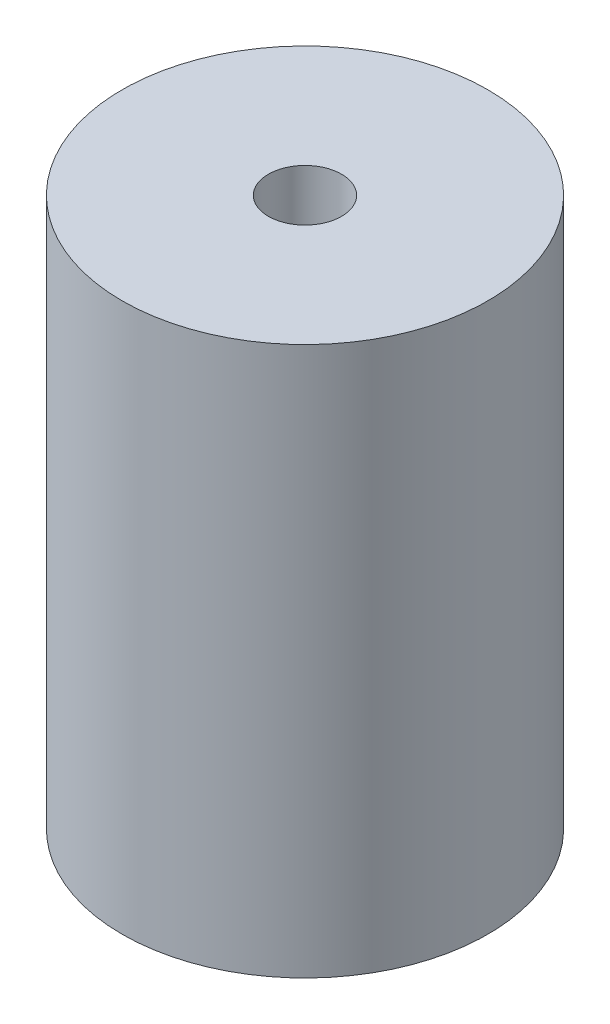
ISO-10303-21;
HEADER;
FILE_DESCRIPTION(('STEP AP214'),'2;1');
FILE_NAME('part.step','',(''),(''),'','','');
FILE_SCHEMA(('AUTOMOTIVE_DESIGN { 1 0 10303 214 1 1 1 1 }'));
ENDSEC;
DATA;
#1=APPLICATION_CONTEXT('core data for automotive mechanical design processes');
#2=APPLICATION_PROTOCOL_DEFINITION('international standard','automotive_design',2000,#1);
#3=PRODUCT_CONTEXT('',#1,'mechanical');
#4=PRODUCT('Part','Part','',(#3));
#5=PRODUCT_RELATED_PRODUCT_CATEGORY('part','',(#4));
#6=PRODUCT_DEFINITION_FORMATION('','',#4);
#7=PRODUCT_DEFINITION_CONTEXT('part definition',#1,'design');
#8=PRODUCT_DEFINITION('design','',#6,#7);
#9=PRODUCT_DEFINITION_SHAPE('','',#8);
#10=(LENGTH_UNIT() NAMED_UNIT(*) SI_UNIT(.MILLI.,.METRE.));
#11=(NAMED_UNIT(*) PLANE_ANGLE_UNIT() SI_UNIT($,.RADIAN.));
#12=(NAMED_UNIT(*) SI_UNIT($,.STERADIAN.) SOLID_ANGLE_UNIT());
#13=UNCERTAINTY_MEASURE_WITH_UNIT(LENGTH_MEASURE(1.E-05),#10,'distance_accuracy_value','');
#14=(GEOMETRIC_REPRESENTATION_CONTEXT(3) GLOBAL_UNCERTAINTY_ASSIGNED_CONTEXT((#13)) GLOBAL_UNIT_ASSIGNED_CONTEXT((#10,
#11,#12)) REPRESENTATION_CONTEXT('',''));
#15=CARTESIAN_POINT('',(0.,0.,0.));
#16=DIRECTION('',(0.,0.,1.));
#17=DIRECTION('',(1.,0.,0.));
#18=AXIS2_PLACEMENT_3D('',#15,#16,#17);
#19=CARTESIAN_POINT('',(0.,30.,0.));
#20=DIRECTION('',(0.,-1.,0.));
#21=DIRECTION('',(0.,0.,-1.));
#22=AXIS2_PLACEMENT_3D('',#19,#20,#21);
#23=CYLINDRICAL_SURFACE('',#22,10.);
#24=CARTESIAN_POINT('',(0.,30.,0.));
#25=DIRECTION('',(0.,1.,0.));
#26=DIRECTION('',(0.,0.,1.));
#27=AXIS2_PLACEMENT_3D('',#24,#25,#26);
#28=CIRCLE('',#27,10.);
#29=CARTESIAN_POINT('',(0.,30.,10.));
#30=VERTEX_POINT('',#29);
#31=EDGE_CURVE('E10',#30,#30,#28,.T.);
#32=ORIENTED_EDGE('',*,*,#31,.F.);
#33=EDGE_LOOP('',(#32));
#34=FACE_BOUND('',#33,.T.);
#35=CARTESIAN_POINT('',(0.,0.,0.));
#36=DIRECTION('',(0.,1.,0.));
#37=DIRECTION('',(0.,0.,1.));
#38=AXIS2_PLACEMENT_3D('',#35,#36,#37);
#39=CIRCLE('',#38,10.);
#40=CARTESIAN_POINT('',(0.,0.,10.));
#41=VERTEX_POINT('',#40);
#42=EDGE_CURVE('E36',#41,#41,#39,.T.);
#43=ORIENTED_EDGE('',*,*,#42,.T.);
#44=EDGE_LOOP('',(#43));
#45=FACE_BOUND('',#44,.T.);
#46=ADVANCED_FACE('F33',(#34,#45),#23,.T.);
#47=CARTESIAN_POINT('',(0.,30.,0.));
#48=DIRECTION('',(0.,1.,0.));
#49=DIRECTION('',(0.,0.,1.));
#50=AXIS2_PLACEMENT_3D('',#47,#48,#49);
#51=PLANE('',#50);
#52=CARTESIAN_POINT('',(0.,30.,0.));
#53=DIRECTION('',(0.,1.,0.));
#54=DIRECTION('',(0.,0.,1.));
#55=AXIS2_PLACEMENT_3D('',#52,#53,#54);
#56=CIRCLE('',#55,2.);
#57=CARTESIAN_POINT('',(0.,30.,2.));
#58=VERTEX_POINT('',#57);
#59=EDGE_CURVE('E45',#58,#58,#56,.T.);
#60=ORIENTED_EDGE('',*,*,#59,.F.);
#61=EDGE_LOOP('',(#60));
#62=FACE_BOUND('',#61,.T.);
#63=ORIENTED_EDGE('',*,*,#31,.T.);
#64=EDGE_LOOP('',(#63));
#65=FACE_BOUND('',#64,.T.);
#66=ADVANCED_FACE('F70',(#62,#65),#51,.T.);
#67=CARTESIAN_POINT('',(0.,0.,0.));
#68=DIRECTION('',(0.,1.,0.));
#69=DIRECTION('',(0.,0.,1.));
#70=AXIS2_PLACEMENT_3D('',#67,#68,#69);
#71=PLANE('',#70);
#72=CARTESIAN_POINT('',(0.,0.,0.));
#73=DIRECTION('',(0.,-1.,0.));
#74=DIRECTION('',(0.,0.,-1.));
#75=AXIS2_PLACEMENT_3D('',#72,#73,#74);
#76=CIRCLE('',#75,4.);
#77=CARTESIAN_POINT('',(0.,0.,-4.));
#78=VERTEX_POINT('',#77);
#79=EDGE_CURVE('E51',#78,#78,#76,.T.);
#80=ORIENTED_EDGE('',*,*,#79,.F.);
#81=EDGE_LOOP('',(#80));
#82=FACE_BOUND('',#81,.T.);
#83=ORIENTED_EDGE('',*,*,#42,.F.);
#84=EDGE_LOOP('',(#83));
#85=FACE_BOUND('',#84,.T.);
#86=ADVANCED_FACE('F66',(#82,#85),#71,.F.);
#87=CARTESIAN_POINT('',(0.,22.,0.));
#88=DIRECTION('',(0.,1.,0.));
#89=DIRECTION('',(0.,0.,1.));
#90=AXIS2_PLACEMENT_3D('',#87,#88,#89);
#91=CYLINDRICAL_SURFACE('',#90,2.);
#92=CARTESIAN_POINT('',(0.,22.,0.));
#93=DIRECTION('',(0.,1.,0.));
#94=DIRECTION('',(0.,0.,1.));
#95=AXIS2_PLACEMENT_3D('',#92,#93,#94);
#96=CIRCLE('',#95,2.);
#97=CARTESIAN_POINT('',(0.,22.,2.));
#98=VERTEX_POINT('',#97);
#99=EDGE_CURVE('E43',#98,#98,#96,.T.);
#100=ORIENTED_EDGE('',*,*,#99,.F.);
#101=EDGE_LOOP('',(#100));
#102=FACE_BOUND('',#101,.T.);
#103=ORIENTED_EDGE('',*,*,#59,.T.);
#104=EDGE_LOOP('',(#103));
#105=FACE_BOUND('',#104,.T.);
#106=ADVANCED_FACE('F69',(#102,#105),#91,.F.);
#107=CARTESIAN_POINT('',(0.,22.,0.));
#108=DIRECTION('',(0.,1.,0.));
#109=DIRECTION('',(0.,0.,1.));
#110=AXIS2_PLACEMENT_3D('',#107,#108,#109);
#111=PLANE('',#110);
#112=ORIENTED_EDGE('',*,*,#99,.T.);
#113=EDGE_LOOP('',(#112));
#114=FACE_BOUND('',#113,.T.);
#115=ADVANCED_FACE('F62',(#114),#111,.T.);
#116=CARTESIAN_POINT('',(0.,8.,0.));
#117=DIRECTION('',(0.,-1.,0.));
#118=DIRECTION('',(0.,0.,-1.));
#119=AXIS2_PLACEMENT_3D('',#116,#117,#118);
#120=CYLINDRICAL_SURFACE('',#119,4.);
#121=CARTESIAN_POINT('',(0.,8.,0.));
#122=DIRECTION('',(0.,-1.,0.));
#123=DIRECTION('',(0.,0.,-1.));
#124=AXIS2_PLACEMENT_3D('',#121,#122,#123);
#125=CIRCLE('',#124,4.);
#126=CARTESIAN_POINT('',(0.,8.,-4.));
#127=VERTEX_POINT('',#126);
#128=EDGE_CURVE('E48',#127,#127,#125,.T.);
#129=ORIENTED_EDGE('',*,*,#128,.F.);
#130=EDGE_LOOP('',(#129));
#131=FACE_BOUND('',#130,.T.);
#132=ORIENTED_EDGE('',*,*,#79,.T.);
#133=EDGE_LOOP('',(#132));
#134=FACE_BOUND('',#133,.T.);
#135=ADVANCED_FACE('F59',(#131,#134),#120,.F.);
#136=CARTESIAN_POINT('',(0.,8.,0.));
#137=DIRECTION('',(0.,-1.,0.));
#138=DIRECTION('',(0.,0.,-1.));
#139=AXIS2_PLACEMENT_3D('',#136,#137,#138);
#140=PLANE('',#139);
#141=ORIENTED_EDGE('',*,*,#128,.T.);
#142=EDGE_LOOP('',(#141));
#143=FACE_BOUND('',#142,.T.);
#144=ADVANCED_FACE('F57',(#143),#140,.T.);
#145=CLOSED_SHELL('',(#46,#66,#86,#106,#115,#135,#144));
#146=MANIFOLD_SOLID_BREP('B2',#145);
#147=ADVANCED_BREP_SHAPE_REPRESENTATION('',(#18,#146),#14);
#148=SHAPE_DEFINITION_REPRESENTATION(#9,#147);
ENDSEC;
END-ISO-10303-21;
